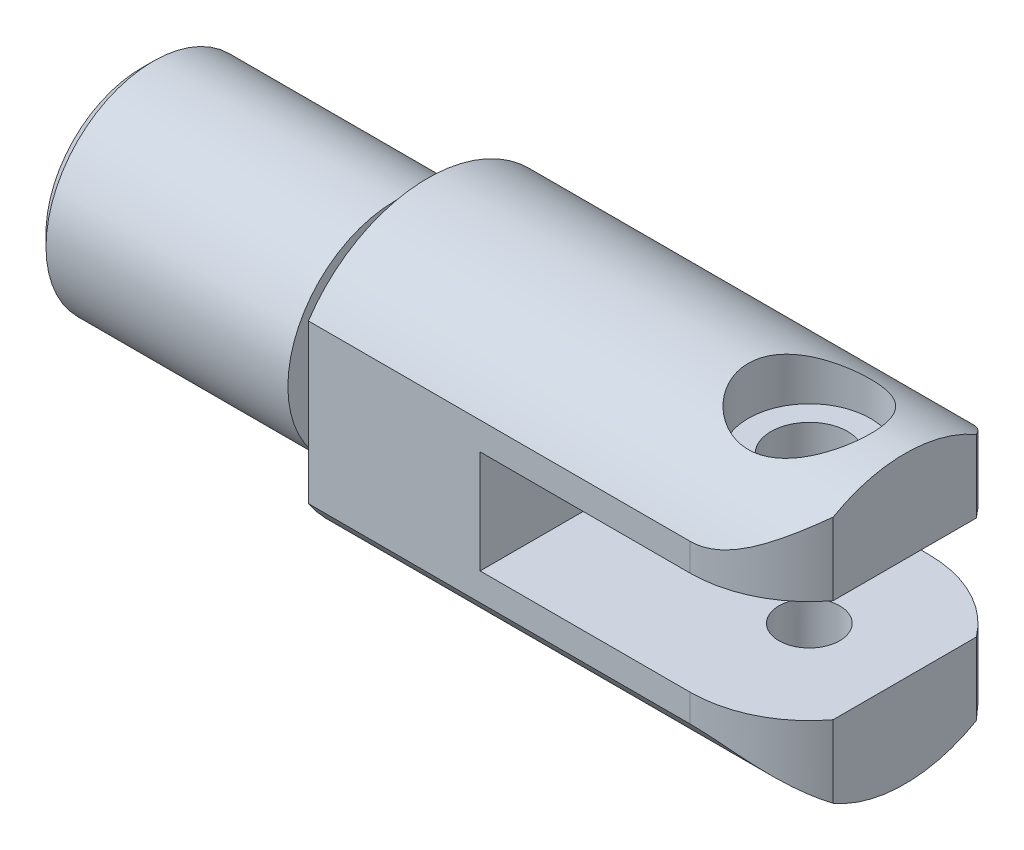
ISO-10303-21;
HEADER;
FILE_DESCRIPTION(('STEP AP214'),'2;1');
FILE_NAME('part.step','',(''),(''),'','','');
FILE_SCHEMA(('AUTOMOTIVE_DESIGN { 1 0 10303 214 1 1 1 1 }'));
ENDSEC;
DATA;
#1=APPLICATION_CONTEXT('core data for automotive mechanical design processes');
#2=APPLICATION_PROTOCOL_DEFINITION('international standard','automotive_design',2000,#1);
#3=PRODUCT_CONTEXT('',#1,'mechanical');
#4=PRODUCT('Part','Part','',(#3));
#5=PRODUCT_RELATED_PRODUCT_CATEGORY('part','',(#4));
#6=PRODUCT_DEFINITION_FORMATION('','',#4);
#7=PRODUCT_DEFINITION_CONTEXT('part definition',#1,'design');
#8=PRODUCT_DEFINITION('design','',#6,#7);
#9=PRODUCT_DEFINITION_SHAPE('','',#8);
#10=(LENGTH_UNIT() NAMED_UNIT(*) SI_UNIT(.MILLI.,.METRE.));
#11=(NAMED_UNIT(*) PLANE_ANGLE_UNIT() SI_UNIT($,.RADIAN.));
#12=(NAMED_UNIT(*) SI_UNIT($,.STERADIAN.) SOLID_ANGLE_UNIT());
#13=UNCERTAINTY_MEASURE_WITH_UNIT(LENGTH_MEASURE(1.E-05),#10,'distance_accuracy_value','');
#14=(GEOMETRIC_REPRESENTATION_CONTEXT(3) GLOBAL_UNCERTAINTY_ASSIGNED_CONTEXT((#13)) GLOBAL_UNIT_ASSIGNED_CONTEXT((#10,
#11,#12)) REPRESENTATION_CONTEXT('',''));
#15=CARTESIAN_POINT('',(0.,0.,0.));
#16=DIRECTION('',(0.,0.,1.));
#17=DIRECTION('',(1.,0.,0.));
#18=AXIS2_PLACEMENT_3D('',#15,#16,#17);
#19=CARTESIAN_POINT('',(-8.17722948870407,0.,0.));
#20=DIRECTION('',(-1.,0.,0.));
#21=DIRECTION('',(0.,0.,1.));
#22=AXIS2_PLACEMENT_3D('',#19,#20,#21);
#23=CYLINDRICAL_SURFACE('',#22,9.525);
#24=CARTESIAN_POINT('',(21.336,9.525,0.));
#25=CARTESIAN_POINT('',(21.3360008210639,9.52499934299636,0.10866366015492));
#26=CARTESIAN_POINT('',(21.3403642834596,9.52313534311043,0.21736117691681));
#27=CARTESIAN_POINT('',(21.3577753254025,9.51572643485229,0.433977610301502));
#28=CARTESIAN_POINT('',(21.3708282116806,9.5101792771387,0.541896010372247));
#29=CARTESIAN_POINT('',(21.4055197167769,9.49553324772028,0.756330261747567));
#30=CARTESIAN_POINT('',(21.4271754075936,9.48642731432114,0.862842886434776));
#31=CARTESIAN_POINT('',(21.4788407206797,9.46490766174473,1.07349454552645));
#32=CARTESIAN_POINT('',(21.508853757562,9.45249259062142,1.17763259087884));
#33=CARTESIAN_POINT('',(21.6107652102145,9.41084087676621,1.4846075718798));
#34=CARTESIAN_POINT('',(21.6946983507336,9.3771259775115,1.68299258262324));
#35=CARTESIAN_POINT('',(21.8917585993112,9.30102487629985,2.06256219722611));
#36=CARTESIAN_POINT('',(22.0048776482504,9.25864106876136,2.24375153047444));
#37=CARTESIAN_POINT('',(22.2633646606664,9.16693748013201,2.59366760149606));
#38=CARTESIAN_POINT('',(22.4100123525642,9.11738344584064,2.7613892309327));
#39=CARTESIAN_POINT('',(22.7286289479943,9.01791633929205,3.07071174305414));
#40=CARTESIAN_POINT('',(22.900611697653,8.96800308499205,3.21229824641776));
#41=CARTESIAN_POINT('',(23.276069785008,8.87052609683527,3.47271718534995));
#42=CARTESIAN_POINT('',(23.4807200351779,8.82322080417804,3.58997709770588));
#43=CARTESIAN_POINT('',(23.8017672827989,8.76086669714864,3.73841034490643));
#44=CARTESIAN_POINT('',(23.9111729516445,8.74151020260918,3.78332392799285));
#45=CARTESIAN_POINT('',(24.1339708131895,8.70633633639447,3.86358074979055));
#46=CARTESIAN_POINT('',(24.2473608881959,8.69051711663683,3.89892898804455));
#47=CARTESIAN_POINT('',(24.4715910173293,8.66369983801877,3.95814785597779));
#48=CARTESIAN_POINT('',(24.5822807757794,8.65250238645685,3.98249880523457));
#49=CARTESIAN_POINT('',(24.8055966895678,8.63426151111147,4.02189336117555));
#50=CARTESIAN_POINT('',(24.918221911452,8.62721613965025,4.0369413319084));
#51=CARTESIAN_POINT('',(25.1444942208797,8.61754258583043,4.05755040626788));
#52=CARTESIAN_POINT('',(25.2581410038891,8.61491312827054,4.06311424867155));
#53=CARTESIAN_POINT('',(25.4855107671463,8.61416958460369,4.06469042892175));
#54=CARTESIAN_POINT('',(25.5992337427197,8.61605524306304,4.06070330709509));
#55=CARTESIAN_POINT('',(25.8165554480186,8.62393394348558,4.04394188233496));
#56=CARTESIAN_POINT('',(25.9202245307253,8.62958002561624,4.0319095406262));
#57=CARTESIAN_POINT('',(26.1260936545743,8.64443007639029,3.99996913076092));
#58=CARTESIAN_POINT('',(26.228293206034,8.65363520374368,3.98005849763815));
#59=CARTESIAN_POINT('',(26.5316009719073,8.68618548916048,3.90878671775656));
#60=CARTESIAN_POINT('',(26.7295952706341,8.71447270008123,3.84587168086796));
#61=CARTESIAN_POINT('',(27.1163154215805,8.78168870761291,3.68983240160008));
#62=CARTESIAN_POINT('',(27.3047461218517,8.82083552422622,3.59608102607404));
#63=CARTESIAN_POINT('',(27.6639861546,8.90531591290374,3.3814583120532));
#64=CARTESIAN_POINT('',(27.834788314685,8.95065198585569,3.26057599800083));
#65=CARTESIAN_POINT('',(28.1698907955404,9.04730919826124,2.98250361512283));
#66=CARTESIAN_POINT('',(28.3322585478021,9.09880384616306,2.82303927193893));
#67=CARTESIAN_POINT('',(28.628615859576,9.19858639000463,2.47865956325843));
#68=CARTESIAN_POINT('',(28.7625981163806,9.24687345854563,2.29373766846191));
#69=CARTESIAN_POINT('',(29.0014011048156,9.33632842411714,1.89757838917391));
#70=CARTESIAN_POINT('',(29.1053993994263,9.37728559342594,1.68579411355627));
#71=CARTESIAN_POINT('',(29.275607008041,9.44583248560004,1.24554106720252));
#72=CARTESIAN_POINT('',(29.3418382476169,9.47342996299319,1.01708206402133));
#73=CARTESIAN_POINT('',(29.4305034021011,9.51067755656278,0.566077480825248));
#74=CARTESIAN_POINT('',(29.4555276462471,9.52138717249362,0.344128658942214));
#75=CARTESIAN_POINT('',(29.468836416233,9.52706177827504,-0.101038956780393));
#76=CARTESIAN_POINT('',(29.4571321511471,9.52203157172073,-0.324257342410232));
#77=CARTESIAN_POINT('',(29.3991377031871,9.49747404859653,-0.753254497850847));
#78=CARTESIAN_POINT('',(29.3546985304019,9.47872294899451,-0.959333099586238));
#79=CARTESIAN_POINT('',(29.2351069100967,9.42945477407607,-1.36086413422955));
#80=CARTESIAN_POINT('',(29.1599506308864,9.39893623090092,-1.55631523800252));
#81=CARTESIAN_POINT('',(28.9786182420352,9.32785482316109,-1.93794208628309));
#82=CARTESIAN_POINT('',(28.8715471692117,9.28700818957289,-2.12363793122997));
#83=CARTESIAN_POINT('',(28.6303932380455,9.19958482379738,-2.47509872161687));
#84=CARTESIAN_POINT('',(28.4962988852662,9.15300565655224,-2.64085513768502));
#85=CARTESIAN_POINT('',(28.19323620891,9.05481219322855,-2.96075320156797));
#86=CARTESIAN_POINT('',(28.0224102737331,9.003081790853,-3.11310036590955));
#87=CARTESIAN_POINT('',(27.6567195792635,8.90345400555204,-3.38755158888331));
#88=CARTESIAN_POINT('',(27.4618483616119,8.85555765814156,-3.50964749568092));
#89=CARTESIAN_POINT('',(27.1533296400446,8.79052306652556,-3.66819683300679));
#90=CARTESIAN_POINT('',(27.0467491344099,8.76982477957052,-3.7172756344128));
#91=CARTESIAN_POINT('',(26.8292663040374,8.73160336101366,-3.80618853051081));
#92=CARTESIAN_POINT('',(26.7183659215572,8.71407882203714,-3.8460267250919));
#93=CARTESIAN_POINT('',(26.4930881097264,8.68285270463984,-3.91601382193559));
#94=CARTESIAN_POINT('',(26.3787124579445,8.66914920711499,-3.94616758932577));
#95=CARTESIAN_POINT('',(26.1473474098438,8.64608681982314,-3.99644541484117));
#96=CARTESIAN_POINT('',(26.0303582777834,8.63672749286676,-4.01657048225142));
#97=CARTESIAN_POINT('',(25.8042315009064,8.62329579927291,-4.04532123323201));
#98=CARTESIAN_POINT('',(25.6952155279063,8.6188600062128,-4.05473887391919));
#99=CARTESIAN_POINT('',(25.476650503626,8.61414322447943,-4.06475000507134));
#100=CARTESIAN_POINT('',(25.3671012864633,8.61386362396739,-4.06534054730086));
#101=CARTESIAN_POINT('',(25.1484361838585,8.61747512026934,-4.05768013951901));
#102=CARTESIAN_POINT('',(25.0393200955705,8.62136395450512,-4.04943398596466));
#103=CARTESIAN_POINT('',(24.8223078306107,8.63316177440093,-4.02421710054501));
#104=CARTESIAN_POINT('',(24.7144121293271,8.64107227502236,-4.00724308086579));
#105=CARTESIAN_POINT('',(24.4048386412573,8.66944805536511,-3.94567511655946));
#106=CARTESIAN_POINT('',(24.205698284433,8.69481262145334,-3.88995921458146));
#107=CARTESIAN_POINT('',(23.8196904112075,8.75616396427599,-3.74979969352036));
#108=CARTESIAN_POINT('',(23.6328263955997,8.79215375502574,-3.66534792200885));
#109=CARTESIAN_POINT('',(23.263919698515,8.87344533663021,-3.46410833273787));
#110=CARTESIAN_POINT('',(23.0828854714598,8.91918460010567,-3.3456471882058));
#111=CARTESIAN_POINT('',(22.7422999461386,9.01365945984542,-3.0820743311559));
#112=CARTESIAN_POINT('',(22.582756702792,9.06239616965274,-2.93695267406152));
#113=CARTESIAN_POINT('',(22.2767817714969,9.16195780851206,-2.61062025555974));
#114=CARTESIAN_POINT('',(22.1323402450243,9.21264956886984,-2.42747859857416));
#115=CARTESIAN_POINT('',(21.9402781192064,9.28308520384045,-2.13543173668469));
#116=CARTESIAN_POINT('',(21.880318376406,9.30564628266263,-2.03510428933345));
#117=CARTESIAN_POINT('',(21.7690823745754,9.34828589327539,-1.82926039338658));
#118=CARTESIAN_POINT('',(21.717802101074,9.3683655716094,-1.72374637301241));
#119=CARTESIAN_POINT('',(21.6250734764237,9.40520149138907,-1.5097783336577));
#120=CARTESIAN_POINT('',(21.5834942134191,9.42200141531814,-1.40138850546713));
#121=CARTESIAN_POINT('',(21.5096674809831,9.4521468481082,-1.18105749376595));
#122=CARTESIAN_POINT('',(21.4774155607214,9.46549400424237,-1.06911803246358));
#123=CARTESIAN_POINT('',(21.4226489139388,9.48832084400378,-0.842792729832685));
#124=CARTESIAN_POINT('',(21.4001104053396,9.49780997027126,-0.728413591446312));
#125=CARTESIAN_POINT('',(21.3649377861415,9.51267573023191,-0.497936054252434));
#126=CARTESIAN_POINT('',(21.3522965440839,9.51805532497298,-0.381838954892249));
#127=CARTESIAN_POINT('',(21.3417844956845,9.52253317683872,-0.221234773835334));
#128=CARTESIAN_POINT('',(21.3396159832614,9.52345765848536,-0.17702276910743));
#129=CARTESIAN_POINT('',(21.3367235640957,9.52469120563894,-0.0885423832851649));
#130=CARTESIAN_POINT('',(21.3359996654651,9.52500026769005,-0.0442740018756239));
#131=CARTESIAN_POINT('',(21.336,9.525,0.));
#132=B_SPLINE_CURVE_WITH_KNOTS('',3,(#24,#25,#26,#27,#28,#29,#30,#31,#32,#33,#34,#35,#36,#37,
#38,#39,#40,#41,#42,#43,#44,#45,#46,#47,#48,#49,#50,#51,#52,#53,#54,#55,#56,#57,#58,#59,#60,#61,
#62,#63,#64,#65,#66,#67,#68,#69,#70,#71,#72,#73,#74,#75,#76,#77,#78,#79,#80,#81,#82,#83,#84,#85,
#86,#87,#88,#89,#90,#91,#92,#93,#94,#95,#96,#97,#98,#99,#100,#101,#102,#103,#104,#105,#106,#107,
#108,#109,#110,#111,#112,#113,#114,#115,#116,#117,#118,#119,#120,#121,#122,#123,#124,#125,#126,
#127,#128,#129,#130,#131),.UNSPECIFIED.,.T.,.F.,(4,2,2,2,2,2,2,2,2,2,2,2,2,2,2,2,2,2,2,2,2,2,2,
2,2,2,2,2,2,2,2,2,2,2,2,2,2,2,2,2,2,2,2,2,2,2,2,2,2,2,2,2,2,4),(0.,0.325945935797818,
0.652091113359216,0.978886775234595,1.30581615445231,1.95670379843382,2.60741190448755,
3.28912343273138,3.97120892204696,4.68888037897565,5.04799133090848,5.40691422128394,
5.74812482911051,6.08917525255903,6.43012717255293,6.77105980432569,7.08423090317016,
7.39750404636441,8.02352392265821,8.66315621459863,9.30304773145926,9.99990659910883,
10.6969445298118,11.4115959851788,12.1258321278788,12.793168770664,13.4603017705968,
14.0923546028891,14.7244863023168,15.3763478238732,16.0284872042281,16.7293758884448,
17.4304532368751,17.7875048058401,18.1443976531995,18.5011109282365,18.8577882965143,
19.1858967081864,19.5141147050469,19.8421546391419,20.1703182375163,20.7923376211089,
21.4145336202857,22.0751103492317,22.7359339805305,23.4482461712,23.8049880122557,
24.1615643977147,24.5130075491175,24.8642827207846,25.2146928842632,25.5648503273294,
25.6976532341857,25.8304568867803),.UNSPECIFIED.);
#133=CARTESIAN_POINT('',(21.336,9.525,0.));
#134=VERTEX_POINT('',#133);
#135=EDGE_CURVE('E503',#134,#134,#132,.T.);
#136=ORIENTED_EDGE('',*,*,#135,.F.);
#137=EDGE_LOOP('',(#136));
#138=FACE_BOUND('',#137,.T.);
#139=CARTESIAN_POINT('',(31.75,8.24889197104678,4.7625));
#140=CARTESIAN_POINT('',(31.6748043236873,8.19100911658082,4.86275569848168));
#141=CARTESIAN_POINT('',(31.5975763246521,8.1319746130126,4.96078527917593));
#142=CARTESIAN_POINT('',(31.4392334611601,8.01195268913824,5.1523799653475));
#143=CARTESIAN_POINT('',(31.3581192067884,7.95096557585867,5.24594576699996));
#144=CARTESIAN_POINT('',(31.1092610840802,7.76563529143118,5.51988299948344));
#145=CARTESIAN_POINT('',(30.9359256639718,7.63886409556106,5.69359538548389));
#146=CARTESIAN_POINT('',(30.5738875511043,7.38068891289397,6.02457559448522));
#147=CARTESIAN_POINT('',(30.3850622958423,7.24925382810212,6.1816840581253));
#148=CARTESIAN_POINT('',(29.9938716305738,6.98601400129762,6.47768598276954));
#149=CARTESIAN_POINT('',(29.7915073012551,6.85420928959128,6.61658089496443));
#150=CARTESIAN_POINT('',(29.4220539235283,6.62441830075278,6.84562261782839));
#151=CARTESIAN_POINT('',(29.2577580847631,6.52572013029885,6.93958016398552));
#152=CARTESIAN_POINT('',(28.9209376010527,6.33243000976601,7.116396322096));
#153=CARTESIAN_POINT('',(28.7484127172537,6.23783817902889,7.19925461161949));
#154=CARTESIAN_POINT('',(28.3952570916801,6.05561623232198,7.3531843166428));
#155=CARTESIAN_POINT('',(28.214649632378,5.96796791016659,7.42428712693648));
#156=CARTESIAN_POINT('',(27.8447621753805,5.80268575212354,7.55417115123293));
#157=CARTESIAN_POINT('',(27.6554869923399,5.7250464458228,7.61295910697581));
#158=CARTESIAN_POINT('',(27.2046239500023,5.56069881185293,7.7342000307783));
#159=CARTESIAN_POINT('',(26.9395792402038,5.47928653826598,7.79159890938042));
#160=CARTESIAN_POINT('',(26.5330358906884,5.38406353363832,7.85741474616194));
#161=CARTESIAN_POINT('',(26.3962251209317,5.35682470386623,7.87596098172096));
#162=CARTESIAN_POINT('',(26.1202355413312,5.31243544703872,7.9059713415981));
#163=CARTESIAN_POINT('',(25.9810584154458,5.29527813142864,7.91744030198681));
#164=CARTESIAN_POINT('',(25.7679784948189,5.27747841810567,7.92930613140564));
#165=CARTESIAN_POINT('',(25.6945293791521,5.27286238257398,7.93237470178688));
#166=CARTESIAN_POINT('',(25.5473912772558,5.2666902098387,7.9364731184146));
#167=CARTESIAN_POINT('',(25.4737021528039,5.2651363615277,7.93750143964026));
#168=CARTESIAN_POINT('',(25.4,5.2651418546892,7.9375));
#169=B_SPLINE_CURVE_WITH_KNOTS('',3,(#139,#140,#141,#142,#143,#144,#145,#146,#147,#148,#149,
#150,#151,#152,#153,#154,#155,#156,#157,#158,#159,#160,#161,#162,#163,#164,#165,#166,#167,#168),
.UNSPECIFIED.,.F.,.F.,(4,2,2,2,2,2,2,2,2,2,2,2,2,2,4),(0.,0.414045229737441,0.828025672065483,
1.65556887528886,2.49044513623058,3.32525483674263,3.96518399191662,4.60513173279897,
5.24334177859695,5.88120151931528,6.72702441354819,7.14874510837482,7.57017731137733,
7.79107009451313,8.01212792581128),.UNSPECIFIED.);
#170=CARTESIAN_POINT('',(31.75,8.24889197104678,4.7625));
#171=VERTEX_POINT('',#170);
#172=CARTESIAN_POINT('',(25.4,5.2651418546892,7.9375));
#173=VERTEX_POINT('',#172);
#174=EDGE_CURVE('E427',#171,#173,#169,.T.);
#175=ORIENTED_EDGE('',*,*,#174,.F.);
#176=CARTESIAN_POINT('',(31.75,0.,0.));
#177=DIRECTION('',(-1.,0.,0.));
#178=DIRECTION('',(0.,0.,1.));
#179=AXIS2_PLACEMENT_3D('',#176,#177,#178);
#180=CIRCLE('',#179,9.525);
#181=CARTESIAN_POINT('',(31.75,8.24889197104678,-4.7625));
#182=VERTEX_POINT('',#181);
#183=EDGE_CURVE('E509',#171,#182,#180,.T.);
#184=ORIENTED_EDGE('',*,*,#183,.T.);
#185=CARTESIAN_POINT('',(25.4,5.26514185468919,-7.9375));
#186=CARTESIAN_POINT('',(25.5418413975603,5.2650396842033,-7.93753374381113));
#187=CARTESIAN_POINT('',(25.6836188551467,5.27087100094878,-7.93369959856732));
#188=CARTESIAN_POINT('',(25.965617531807,5.29360135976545,-7.91856910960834));
#189=CARTESIAN_POINT('',(26.105841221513,5.31047907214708,-7.90728714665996));
#190=CARTESIAN_POINT('',(26.3817769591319,5.35417885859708,-7.87775554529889));
#191=CARTESIAN_POINT('',(26.5175251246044,5.38084819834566,-7.85961280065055));
#192=CARTESIAN_POINT('',(26.7859874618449,5.44294273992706,-7.81674040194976));
#193=CARTESIAN_POINT('',(26.9186999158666,5.47837277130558,-7.7920071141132));
#194=CARTESIAN_POINT('',(27.2325274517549,5.57219881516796,-7.72532904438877));
#195=CARTESIAN_POINT('',(27.411962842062,5.63413014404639,-7.68044859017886));
#196=CARTESIAN_POINT('',(27.763431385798,5.76898125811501,-7.57968084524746));
#197=CARTESIAN_POINT('',(27.9354614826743,5.84190552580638,-7.52378906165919));
#198=CARTESIAN_POINT('',(28.2735372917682,5.99634354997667,-7.40130254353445));
#199=CARTESIAN_POINT('',(28.4395218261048,6.07792328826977,-7.33462320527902));
#200=CARTESIAN_POINT('',(28.7642883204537,6.24667242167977,-7.19145130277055));
#201=CARTESIAN_POINT('',(28.9230677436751,6.33384375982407,-7.11495531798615));
#202=CARTESIAN_POINT('',(29.3025673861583,6.55117422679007,-6.91649632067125));
#203=CARTESIAN_POINT('',(29.5195271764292,6.68325230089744,-6.78941498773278));
#204=CARTESIAN_POINT('',(29.9394884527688,6.94999480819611,-6.51611293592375));
#205=CARTESIAN_POINT('',(30.1424822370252,7.0846606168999,-6.36988178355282));
#206=CARTESIAN_POINT('',(30.5334169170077,7.35210697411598,-6.05920676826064));
#207=CARTESIAN_POINT('',(30.7214221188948,7.48489331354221,-5.89484882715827));
#208=CARTESIAN_POINT('',(31.0826792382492,7.74590186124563,-5.54741398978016));
#209=CARTESIAN_POINT('',(31.2559375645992,7.87412603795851,-5.36434530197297));
#210=CARTESIAN_POINT('',(31.4779051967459,8.04122297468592,-5.10593361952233));
#211=CARTESIAN_POINT('',(31.5337090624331,8.08349217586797,-5.03876844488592));
#212=CARTESIAN_POINT('',(31.6433429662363,8.16699372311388,-4.90226812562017));
#213=CARTESIAN_POINT('',(31.6971736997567,8.20822643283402,-4.83293376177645));
#214=CARTESIAN_POINT('',(31.7500000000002,8.24889197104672,-4.76250000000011));
#215=B_SPLINE_CURVE_WITH_KNOTS('',3,(#185,#186,#187,#188,#189,#190,#191,#192,#193,#194,#195,
#196,#197,#198,#199,#200,#201,#202,#203,#204,#205,#206,#207,#208,#209,#210,#211,#212,#213,#214),
.UNSPECIFIED.,.F.,.F.,(4,2,2,2,2,2,2,2,2,2,2,2,2,2,4),(0.,0.425250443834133,0.849682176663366,
1.26775671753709,1.68606224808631,2.27027970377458,2.85473602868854,3.44402060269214,
4.03351106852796,4.88444421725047,5.735842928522,6.58336661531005,7.43052007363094,
7.72152653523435,8.01242942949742),.UNSPECIFIED.);
#216=CARTESIAN_POINT('',(25.4,5.2651418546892,-7.9375));
#217=VERTEX_POINT('',#216);
#218=EDGE_CURVE('E402',#217,#182,#215,.T.);
#219=ORIENTED_EDGE('',*,*,#218,.F.);
#220=DIRECTION('',(-1.,0.,0.));
#221=VECTOR('',#220,1.);
#222=CARTESIAN_POINT('',(-8.17722948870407,5.26514185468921,-7.93749999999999));
#223=LINE('',#222,#221);
#224=CARTESIAN_POINT('',(0.,5.2651418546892,-7.9375));
#225=VERTEX_POINT('',#224);
#226=EDGE_CURVE('E385',#225,#217,#223,.F.);
#227=ORIENTED_EDGE('',*,*,#226,.F.);
#228=CARTESIAN_POINT('',(0.,0.,0.));
#229=DIRECTION('',(-1.,0.,0.));
#230=DIRECTION('',(0.,0.,1.));
#231=AXIS2_PLACEMENT_3D('',#228,#229,#230);
#232=CIRCLE('',#231,9.525);
#233=CARTESIAN_POINT('',(0.,5.2651418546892,7.9375));
#234=VERTEX_POINT('',#233);
#235=EDGE_CURVE('E521',#234,#225,#232,.T.);
#236=ORIENTED_EDGE('',*,*,#235,.F.);
#237=DIRECTION('',(-1.,0.,0.));
#238=VECTOR('',#237,1.);
#239=CARTESIAN_POINT('',(-8.17722948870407,5.26514185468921,7.93749999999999));
#240=LINE('',#239,#238);
#241=EDGE_CURVE('E398',#173,#234,#240,.T.);
#242=ORIENTED_EDGE('',*,*,#241,.F.);
#243=EDGE_LOOP('',(#175,#184,#219,#227,#236,#242));
#244=FACE_BOUND('',#243,.T.);
#245=ADVANCED_FACE('F270',(#138,#244),#23,.T.);
#246=CARTESIAN_POINT('',(23.3807,-9.525,0.));
#247=CARTESIAN_POINT('',(23.3807039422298,-9.52499792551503,0.112080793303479));
#248=CARTESIAN_POINT('',(23.3900630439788,-9.52300153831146,0.224210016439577));
#249=CARTESIAN_POINT('',(23.4272166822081,-9.51523028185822,0.445289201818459));
#250=CARTESIAN_POINT('',(23.4550249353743,-9.50945260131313,0.554236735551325));
#251=CARTESIAN_POINT('',(23.528171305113,-9.49476274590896,0.765725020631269));
#252=CARTESIAN_POINT('',(23.5734916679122,-9.48585374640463,0.868272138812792));
#253=CARTESIAN_POINT('',(23.6803207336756,-9.46586534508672,1.06430217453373));
#254=CARTESIAN_POINT('',(23.7418288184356,-9.45478602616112,1.15778543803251));
#255=CARTESIAN_POINT('',(23.8802725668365,-9.43148541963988,1.33445303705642));
#256=CARTESIAN_POINT('',(23.9574060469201,-9.4192506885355,1.41748059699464));
#257=CARTESIAN_POINT('',(24.1244861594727,-9.3951140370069,1.5695212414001));
#258=CARTESIAN_POINT('',(24.2144338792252,-9.38321214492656,1.63853313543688));
#259=CARTESIAN_POINT('',(24.4057367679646,-9.36095669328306,1.76126616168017));
#260=CARTESIAN_POINT('',(24.5072001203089,-9.350620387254,1.814822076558));
#261=CARTESIAN_POINT('',(24.7179413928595,-9.33285866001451,1.90406360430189));
#262=CARTESIAN_POINT('',(24.8272184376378,-9.32543291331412,1.93975121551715));
#263=CARTESIAN_POINT('',(25.048789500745,-9.31446967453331,1.99172833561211));
#264=CARTESIAN_POINT('',(25.1610158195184,-9.31087678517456,2.00829450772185));
#265=CARTESIAN_POINT('',(25.3867079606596,-9.30781955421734,2.02241841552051));
#266=CARTESIAN_POINT('',(25.5001736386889,-9.3083547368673,2.01997834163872));
#267=CARTESIAN_POINT('',(25.7230789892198,-9.31344296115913,1.99638204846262));
#268=CARTESIAN_POINT('',(25.8325543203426,-9.31792734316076,1.97554564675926));
#269=CARTESIAN_POINT('',(26.0464193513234,-9.33030030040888,1.91625416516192));
#270=CARTESIAN_POINT('',(26.150808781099,-9.33818905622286,1.87779815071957));
#271=CARTESIAN_POINT('',(26.352446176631,-9.35655049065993,1.78406110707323));
#272=CARTESIAN_POINT('',(26.4496345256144,-9.3670421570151,1.72865571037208));
#273=CARTESIAN_POINT('',(26.6334534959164,-9.38941542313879,1.60268021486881));
#274=CARTESIAN_POINT('',(26.7200827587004,-9.40129720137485,1.53210816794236));
#275=CARTESIAN_POINT('',(26.882167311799,-9.42540756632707,1.37610254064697));
#276=CARTESIAN_POINT('',(26.9573604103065,-9.43763830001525,1.29039662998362));
#277=CARTESIAN_POINT('',(27.0923470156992,-9.46084863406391,1.1074548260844));
#278=CARTESIAN_POINT('',(27.15214027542,-9.47182821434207,1.01021874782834));
#279=CARTESIAN_POINT('',(27.2546886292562,-9.49133145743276,0.806667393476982));
#280=CARTESIAN_POINT('',(27.2974109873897,-9.49985039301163,0.700335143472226));
#281=CARTESIAN_POINT('',(27.3643103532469,-9.51343711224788,0.481780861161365));
#282=CARTESIAN_POINT('',(27.3884898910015,-9.51850536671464,0.369559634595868));
#283=CARTESIAN_POINT('',(27.4172396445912,-9.52455318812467,0.144663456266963));
#284=CARTESIAN_POINT('',(27.4221682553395,-9.52560747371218,0.0320362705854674));
#285=CARTESIAN_POINT('',(27.4132453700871,-9.5237172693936,-0.192432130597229));
#286=CARTESIAN_POINT('',(27.399395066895,-9.52077303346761,-0.304273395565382));
#287=CARTESIAN_POINT('',(27.3536049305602,-9.51126361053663,-0.52281924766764));
#288=CARTESIAN_POINT('',(27.321851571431,-9.50473576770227,-0.629564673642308));
#289=CARTESIAN_POINT('',(27.2413624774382,-9.48878918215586,-0.836214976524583));
#290=CARTESIAN_POINT('',(27.1926253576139,-9.47937020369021,-0.936119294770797));
#291=CARTESIAN_POINT('',(27.0787949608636,-9.45850108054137,-1.1277443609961));
#292=CARTESIAN_POINT('',(27.0134892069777,-9.44702516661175,-1.21933602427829));
#293=CARTESIAN_POINT('',(26.8686568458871,-9.42337054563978,-1.39038918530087));
#294=CARTESIAN_POINT('',(26.78912851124,-9.41119175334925,-1.46984920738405));
#295=CARTESIAN_POINT('',(26.6164685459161,-9.38724819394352,-1.61578809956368));
#296=CARTESIAN_POINT('',(26.5231260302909,-9.37549418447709,-1.68201955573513));
#297=CARTESIAN_POINT('',(26.3264313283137,-9.35397178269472,-1.79786615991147));
#298=CARTESIAN_POINT('',(26.2230795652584,-9.34420330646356,-1.84748201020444));
#299=CARTESIAN_POINT('',(26.0098445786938,-9.32784749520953,-1.92836475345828));
#300=CARTESIAN_POINT('',(25.9000009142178,-9.3212427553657,-1.9597322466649));
#301=CARTESIAN_POINT('',(25.6764449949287,-9.31192869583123,-2.00352672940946));
#302=CARTESIAN_POINT('',(25.5627333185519,-9.30921879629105,-2.01595653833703));
#303=CARTESIAN_POINT('',(25.3371598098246,-9.30803619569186,-2.02140852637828));
#304=CARTESIAN_POINT('',(25.2253077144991,-9.30947795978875,-2.01482247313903));
#305=CARTESIAN_POINT('',(25.0043454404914,-9.31624365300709,-1.98330139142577));
#306=CARTESIAN_POINT('',(24.8952352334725,-9.32156754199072,-1.95836655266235));
#307=CARTESIAN_POINT('',(24.6831423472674,-9.33545717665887,-1.89103972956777));
#308=CARTESIAN_POINT('',(24.5801419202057,-9.34401294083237,-1.84870145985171));
#309=CARTESIAN_POINT('',(24.3826469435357,-9.3634068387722,-1.74781702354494));
#310=CARTESIAN_POINT('',(24.288153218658,-9.37424519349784,-1.68926928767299));
#311=CARTESIAN_POINT('',(24.1084154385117,-9.39724086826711,-1.55631419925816));
#312=CARTESIAN_POINT('',(24.0233816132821,-9.40941936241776,-1.48162625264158));
#313=CARTESIAN_POINT('',(23.8669251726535,-9.43357733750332,-1.31908354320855));
#314=CARTESIAN_POINT('',(23.7955056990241,-9.44555677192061,-1.23122574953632));
#315=CARTESIAN_POINT('',(23.6674868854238,-9.46813741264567,-1.04356508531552));
#316=CARTESIAN_POINT('',(23.6110761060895,-9.47872031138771,-0.94363126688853));
#317=CARTESIAN_POINT('',(23.5159404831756,-9.49713321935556,-0.735500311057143));
#318=CARTESIAN_POINT('',(23.4772003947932,-9.50496560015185,-0.627310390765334));
#319=CARTESIAN_POINT('',(23.4256324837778,-9.5155513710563,-0.432467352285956));
#320=CARTESIAN_POINT('',(23.4088141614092,-9.51907311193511,-0.346889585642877));
#321=CARTESIAN_POINT('',(23.3863466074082,-9.52379818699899,-0.174217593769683));
#322=CARTESIAN_POINT('',(23.3806969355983,-9.52500161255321,-0.0871234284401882));
#323=CARTESIAN_POINT('',(23.3807,-9.525,0.));
#324=B_SPLINE_CURVE_WITH_KNOTS('',3,(#246,#247,#248,#249,#250,#251,#252,#253,#254,#255,#256,
#257,#258,#259,#260,#261,#262,#263,#264,#265,#266,#267,#268,#269,#270,#271,#272,#273,#274,#275,
#276,#277,#278,#279,#280,#281,#282,#283,#284,#285,#286,#287,#288,#289,#290,#291,#292,#293,#294,
#295,#296,#297,#298,#299,#300,#301,#302,#303,#304,#305,#306,#307,#308,#309,#310,#311,#312,#313,
#314,#315,#316,#317,#318,#319,#320,#321,#322,#323),.UNSPECIFIED.,.T.,.F.,(4,2,2,2,2,2,2,2,2,2,2,
2,2,2,2,2,2,2,2,2,2,2,2,2,2,2,2,2,2,2,2,2,2,2,2,2,2,2,4),(0.,0.335923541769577,
0.672097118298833,1.00793077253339,1.34375160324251,1.68412441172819,2.02452611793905,
2.36844212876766,2.71231966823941,3.0511567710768,3.3899548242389,3.72297640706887,
4.05601565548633,4.39155972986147,4.72714692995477,5.06953880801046,5.41193618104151,
5.75498703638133,6.09799107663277,6.43457808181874,6.77114370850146,7.10426684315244,
7.43741714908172,7.77507719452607,8.11277827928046,8.45630137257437,8.79980994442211,
9.1414064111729,9.48295201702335,9.81751157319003,10.1520676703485,10.4855988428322,
10.8191623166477,11.1590732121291,11.4990624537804,11.8431405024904,12.1869211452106,
12.4480538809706,12.709176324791),.UNSPECIFIED.);
#325=CARTESIAN_POINT('',(23.3807,-9.525,0.));
#326=VERTEX_POINT('',#325);
#327=EDGE_CURVE('E451',#326,#326,#324,.T.);
#328=ORIENTED_EDGE('',*,*,#327,.T.);
#329=EDGE_LOOP('',(#328));
#330=FACE_BOUND('',#329,.T.);
#331=CARTESIAN_POINT('',(25.4,-5.2651418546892,7.9375));
#332=CARTESIAN_POINT('',(25.5418413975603,-5.26503968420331,7.93753374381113));
#333=CARTESIAN_POINT('',(25.6836188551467,-5.27087100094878,7.93369959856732));
#334=CARTESIAN_POINT('',(25.965617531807,-5.29360135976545,7.91856910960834));
#335=CARTESIAN_POINT('',(26.105841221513,-5.31047907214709,7.90728714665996));
#336=CARTESIAN_POINT('',(26.3817769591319,-5.35417885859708,7.87775554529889));
#337=CARTESIAN_POINT('',(26.5175251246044,-5.38084819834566,7.85961280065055));
#338=CARTESIAN_POINT('',(26.7859874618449,-5.44294273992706,7.81674040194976));
#339=CARTESIAN_POINT('',(26.9186999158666,-5.47837277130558,7.7920071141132));
#340=CARTESIAN_POINT('',(27.2325274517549,-5.57219881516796,7.72532904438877));
#341=CARTESIAN_POINT('',(27.411962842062,-5.63413014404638,7.68044859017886));
#342=CARTESIAN_POINT('',(27.763431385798,-5.76898125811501,7.57968084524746));
#343=CARTESIAN_POINT('',(27.9354614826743,-5.84190552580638,7.52378906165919));
#344=CARTESIAN_POINT('',(28.2735372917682,-5.99634354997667,7.40130254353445));
#345=CARTESIAN_POINT('',(28.4395218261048,-6.07792328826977,7.33462320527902));
#346=CARTESIAN_POINT('',(28.7642883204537,-6.24667242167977,7.19145130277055));
#347=CARTESIAN_POINT('',(28.9230677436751,-6.33384375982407,7.11495531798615));
#348=CARTESIAN_POINT('',(29.3025673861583,-6.55117422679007,6.91649632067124));
#349=CARTESIAN_POINT('',(29.5195271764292,-6.68325230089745,6.78941498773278));
#350=CARTESIAN_POINT('',(29.9394884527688,-6.94999480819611,6.51611293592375));
#351=CARTESIAN_POINT('',(30.1424822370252,-7.0846606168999,6.36988178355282));
#352=CARTESIAN_POINT('',(30.5334169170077,-7.35210697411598,6.05920676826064));
#353=CARTESIAN_POINT('',(30.7214221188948,-7.48489331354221,5.89484882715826));
#354=CARTESIAN_POINT('',(31.0826792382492,-7.74590186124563,5.54741398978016));
#355=CARTESIAN_POINT('',(31.2559375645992,-7.87412603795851,5.36434530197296));
#356=CARTESIAN_POINT('',(31.4779051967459,-8.04122297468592,5.10593361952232));
#357=CARTESIAN_POINT('',(31.5337090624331,-8.08349217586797,5.03876844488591));
#358=CARTESIAN_POINT('',(31.6433429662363,-8.16699372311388,4.90226812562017));
#359=CARTESIAN_POINT('',(31.6971736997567,-8.20822643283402,4.83293376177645));
#360=CARTESIAN_POINT('',(31.7500000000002,-8.24889197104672,4.76250000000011));
#361=B_SPLINE_CURVE_WITH_KNOTS('',3,(#331,#332,#333,#334,#335,#336,#337,#338,#339,#340,#341,
#342,#343,#344,#345,#346,#347,#348,#349,#350,#351,#352,#353,#354,#355,#356,#357,#358,#359,#360),
.UNSPECIFIED.,.F.,.F.,(4,2,2,2,2,2,2,2,2,2,2,2,2,2,4),(0.,0.425250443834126,0.849682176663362,
1.26775671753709,1.68606224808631,2.27027970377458,2.85473602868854,3.44402060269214,
4.03351106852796,4.88444421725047,5.73584292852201,6.58336661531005,7.43052007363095,
7.72152653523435,8.01242942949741),.UNSPECIFIED.);
#362=CARTESIAN_POINT('',(25.4,-5.26514185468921,7.9375));
#363=VERTEX_POINT('',#362);
#364=CARTESIAN_POINT('',(31.75,-8.24889197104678,4.7625));
#365=VERTEX_POINT('',#364);
#366=EDGE_CURVE('E434',#363,#365,#361,.T.);
#367=ORIENTED_EDGE('',*,*,#366,.F.);
#368=DIRECTION('',(-1.,0.,0.));
#369=VECTOR('',#368,1.);
#370=CARTESIAN_POINT('',(-8.17722948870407,-5.26514185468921,7.93749999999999));
#371=LINE('',#370,#369);
#372=CARTESIAN_POINT('',(0.,-5.2651418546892,7.9375));
#373=VERTEX_POINT('',#372);
#374=EDGE_CURVE('E396',#373,#363,#371,.F.);
#375=ORIENTED_EDGE('',*,*,#374,.F.);
#376=CARTESIAN_POINT('',(0.,-5.2651418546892,-7.9375));
#377=VERTEX_POINT('',#376);
#378=EDGE_CURVE('E384',#377,#373,#232,.T.);
#379=ORIENTED_EDGE('',*,*,#378,.F.);
#380=DIRECTION('',(-1.,0.,0.));
#381=VECTOR('',#380,1.);
#382=CARTESIAN_POINT('',(-8.17722948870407,-5.26514185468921,-7.93749999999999));
#383=LINE('',#382,#381);
#384=CARTESIAN_POINT('',(25.4,-5.26514185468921,-7.9375));
#385=VERTEX_POINT('',#384);
#386=EDGE_CURVE('E373',#385,#377,#383,.T.);
#387=ORIENTED_EDGE('',*,*,#386,.F.);
#388=CARTESIAN_POINT('',(31.75,-8.24889197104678,-4.7625));
#389=CARTESIAN_POINT('',(31.6748043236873,-8.19100911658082,-4.86275569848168));
#390=CARTESIAN_POINT('',(31.5975763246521,-8.13197461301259,-4.96078527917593));
#391=CARTESIAN_POINT('',(31.4392334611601,-8.01195268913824,-5.15237996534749));
#392=CARTESIAN_POINT('',(31.3581192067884,-7.95096557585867,-5.24594576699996));
#393=CARTESIAN_POINT('',(31.1092610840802,-7.76563529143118,-5.51988299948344));
#394=CARTESIAN_POINT('',(30.9359256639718,-7.63886409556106,-5.69359538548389));
#395=CARTESIAN_POINT('',(30.5738875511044,-7.38068891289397,-6.02457559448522));
#396=CARTESIAN_POINT('',(30.3850622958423,-7.24925382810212,-6.1816840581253));
#397=CARTESIAN_POINT('',(29.9938716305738,-6.98601400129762,-6.47768598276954));
#398=CARTESIAN_POINT('',(29.7915073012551,-6.85420928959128,-6.61658089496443));
#399=CARTESIAN_POINT('',(29.4220539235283,-6.62441830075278,-6.84562261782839));
#400=CARTESIAN_POINT('',(29.2577580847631,-6.52572013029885,-6.93958016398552));
#401=CARTESIAN_POINT('',(28.9209376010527,-6.332430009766,-7.116396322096));
#402=CARTESIAN_POINT('',(28.7484127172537,-6.23783817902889,-7.19925461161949));
#403=CARTESIAN_POINT('',(28.3952570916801,-6.05561623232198,-7.3531843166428));
#404=CARTESIAN_POINT('',(28.214649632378,-5.96796791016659,-7.42428712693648));
#405=CARTESIAN_POINT('',(27.8447621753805,-5.80268575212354,-7.55417115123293));
#406=CARTESIAN_POINT('',(27.6554869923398,-5.7250464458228,-7.61295910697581));
#407=CARTESIAN_POINT('',(27.2046239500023,-5.56069881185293,-7.73420003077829));
#408=CARTESIAN_POINT('',(26.9395792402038,-5.47928653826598,-7.79159890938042));
#409=CARTESIAN_POINT('',(26.5330358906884,-5.38406353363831,-7.85741474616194));
#410=CARTESIAN_POINT('',(26.3962251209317,-5.35682470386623,-7.87596098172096));
#411=CARTESIAN_POINT('',(26.1202355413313,-5.31243544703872,-7.9059713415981));
#412=CARTESIAN_POINT('',(25.9810584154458,-5.29527813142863,-7.91744030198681));
#413=CARTESIAN_POINT('',(25.7679784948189,-5.27747841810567,-7.92930613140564));
#414=CARTESIAN_POINT('',(25.6945293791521,-5.27286238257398,-7.93237470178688));
#415=CARTESIAN_POINT('',(25.5473912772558,-5.26669020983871,-7.9364731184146));
#416=CARTESIAN_POINT('',(25.4737021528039,-5.2651363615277,-7.93750143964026));
#417=CARTESIAN_POINT('',(25.4,-5.26514185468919,-7.9375));
#418=B_SPLINE_CURVE_WITH_KNOTS('',3,(#388,#389,#390,#391,#392,#393,#394,#395,#396,#397,#398,
#399,#400,#401,#402,#403,#404,#405,#406,#407,#408,#409,#410,#411,#412,#413,#414,#415,#416,#417),
.UNSPECIFIED.,.F.,.F.,(4,2,2,2,2,2,2,2,2,2,2,2,2,2,4),(0.,0.414045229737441,0.828025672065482,
1.65556887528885,2.49044513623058,3.32525483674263,3.96518399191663,4.60513173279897,
5.24334177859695,5.88120151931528,6.72702441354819,7.14874510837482,7.57017731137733,
7.79107009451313,8.01212792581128),.UNSPECIFIED.);
#419=CARTESIAN_POINT('',(31.75,-8.24889197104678,-4.7625));
#420=VERTEX_POINT('',#419);
#421=EDGE_CURVE('E359',#420,#385,#418,.T.);
#422=ORIENTED_EDGE('',*,*,#421,.F.);
#423=EDGE_CURVE('E519',#420,#365,#180,.T.);
#424=ORIENTED_EDGE('',*,*,#423,.T.);
#425=EDGE_LOOP('',(#367,#375,#379,#387,#422,#424));
#426=FACE_BOUND('',#425,.T.);
#427=ADVANCED_FACE('F381',(#330,#426),#23,.T.);
#428=CARTESIAN_POINT('',(31.75,9.525,0.));
#429=DIRECTION('',(-1.,0.,0.));
#430=DIRECTION('',(0.,0.,1.));
#431=AXIS2_PLACEMENT_3D('',#428,#429,#430);
#432=PLANE('',#431);
#433=DIRECTION('',(0.,1.,0.));
#434=VECTOR('',#433,1.);
#435=CARTESIAN_POINT('',(31.75,-9.525,4.7625));
#436=LINE('',#435,#434);
#437=CARTESIAN_POINT('',(31.75,-3.429,4.7625));
#438=VERTEX_POINT('',#437);
#439=EDGE_CURVE('E442',#365,#438,#436,.T.);
#440=ORIENTED_EDGE('',*,*,#439,.F.);
#441=ORIENTED_EDGE('',*,*,#423,.F.);
#442=DIRECTION('',(0.,1.,0.));
#443=VECTOR('',#442,1.);
#444=CARTESIAN_POINT('',(31.75,-9.525,-4.7625));
#445=LINE('',#444,#443);
#446=CARTESIAN_POINT('',(31.75,-3.429,-4.7625));
#447=VERTEX_POINT('',#446);
#448=EDGE_CURVE('E365',#447,#420,#445,.F.);
#449=ORIENTED_EDGE('',*,*,#448,.F.);
#450=DIRECTION('',(0.,0.,1.));
#451=VECTOR('',#450,1.);
#452=CARTESIAN_POINT('',(31.75,-3.429,0.));
#453=LINE('',#452,#451);
#454=EDGE_CURVE('E536',#447,#438,#453,.T.);
#455=ORIENTED_EDGE('',*,*,#454,.T.);
#456=EDGE_LOOP('',(#440,#441,#449,#455));
#457=FACE_BOUND('',#456,.T.);
#458=ADVANCED_FACE('F483',(#457),#432,.F.);
#459=CARTESIAN_POINT('',(0.,5.715,0.));
#460=DIRECTION('',(1.,0.,0.));
#461=DIRECTION('',(0.,0.,-1.));
#462=AXIS2_PLACEMENT_3D('',#459,#460,#461);
#463=PLANE('',#462);
#464=CARTESIAN_POINT('',(0.,0.,0.));
#465=DIRECTION('',(-1.,0.,0.));
#466=DIRECTION('',(0.,0.,1.));
#467=AXIS2_PLACEMENT_3D('',#464,#465,#466);
#468=CIRCLE('',#467,5.715);
#469=CARTESIAN_POINT('',(0.,0.,5.715));
#470=VERTEX_POINT('',#469);
#471=EDGE_CURVE('E525',#470,#470,#468,.T.);
#472=ORIENTED_EDGE('',*,*,#471,.F.);
#473=EDGE_LOOP('',(#472));
#474=FACE_BOUND('',#473,.T.);
#475=DIRECTION('',(0.,-1.,0.));
#476=VECTOR('',#475,1.);
#477=CARTESIAN_POINT('',(0.,5.715,7.9375));
#478=LINE('',#477,#476);
#479=EDGE_CURVE('E394',#234,#373,#478,.T.);
#480=ORIENTED_EDGE('',*,*,#479,.F.);
#481=ORIENTED_EDGE('',*,*,#235,.T.);
#482=DIRECTION('',(0.,1.,0.));
#483=VECTOR('',#482,1.);
#484=CARTESIAN_POINT('',(0.,5.715,-7.9375));
#485=LINE('',#484,#483);
#486=EDGE_CURVE('E389',#377,#225,#485,.T.);
#487=ORIENTED_EDGE('',*,*,#486,.F.);
#488=ORIENTED_EDGE('',*,*,#378,.T.);
#489=EDGE_LOOP('',(#480,#481,#487,#488));
#490=FACE_BOUND('',#489,.T.);
#491=ADVANCED_FACE('F485',(#474,#490),#463,.F.);
#492=DIRECTION('',(0.,1.,0.));
#493=VECTOR('',#492,1.);
#494=CARTESIAN_POINT('',(31.75,-9.525,4.7625));
#495=LINE('',#494,#493);
#496=CARTESIAN_POINT('',(31.75,3.429,4.7625));
#497=VERTEX_POINT('',#496);
#498=EDGE_CURVE('E410',#497,#171,#495,.T.);
#499=ORIENTED_EDGE('',*,*,#498,.F.);
#500=DIRECTION('',(0.,0.,-1.));
#501=VECTOR('',#500,1.);
#502=CARTESIAN_POINT('',(31.75,3.429,0.));
#503=LINE('',#502,#501);
#504=CARTESIAN_POINT('',(31.75,3.429,-4.7625));
#505=VERTEX_POINT('',#504);
#506=EDGE_CURVE('E534',#497,#505,#503,.T.);
#507=ORIENTED_EDGE('',*,*,#506,.T.);
#508=DIRECTION('',(0.,1.,0.));
#509=VECTOR('',#508,1.);
#510=CARTESIAN_POINT('',(31.75,-9.525,-4.7625));
#511=LINE('',#510,#509);
#512=EDGE_CURVE('E400',#182,#505,#511,.F.);
#513=ORIENTED_EDGE('',*,*,#512,.F.);
#514=ORIENTED_EDGE('',*,*,#183,.F.);
#515=EDGE_LOOP('',(#499,#507,#513,#514));
#516=FACE_BOUND('',#515,.T.);
#517=ADVANCED_FACE('F479',(#516),#432,.F.);
#518=CARTESIAN_POINT('',(11.43,3.429,-9.525));
#519=DIRECTION('',(-1.,0.,0.));
#520=DIRECTION('',(0.,0.,1.));
#521=AXIS2_PLACEMENT_3D('',#518,#519,#520);
#522=PLANE('',#521);
#523=DIRECTION('',(0.,1.,0.));
#524=VECTOR('',#523,1.);
#525=CARTESIAN_POINT('',(11.43,3.429,7.93749999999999));
#526=LINE('',#525,#524);
#527=CARTESIAN_POINT('',(11.43,-3.429,7.93749999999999));
#528=VERTEX_POINT('',#527);
#529=CARTESIAN_POINT('',(11.43,3.429,7.93749999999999));
#530=VERTEX_POINT('',#529);
#531=EDGE_CURVE('E294',#528,#530,#526,.T.);
#532=ORIENTED_EDGE('',*,*,#531,.F.);
#533=DIRECTION('',(0.,0.,1.));
#534=VECTOR('',#533,1.);
#535=CARTESIAN_POINT('',(11.43,-3.429,-9.525));
#536=LINE('',#535,#534);
#537=CARTESIAN_POINT('',(11.43,-3.429,-7.9375));
#538=VERTEX_POINT('',#537);
#539=EDGE_CURVE('E460',#538,#528,#536,.T.);
#540=ORIENTED_EDGE('',*,*,#539,.F.);
#541=DIRECTION('',(0.,-1.,0.));
#542=VECTOR('',#541,1.);
#543=CARTESIAN_POINT('',(11.43,3.429,-7.9375));
#544=LINE('',#543,#542);
#545=CARTESIAN_POINT('',(11.43,3.429,-7.9375));
#546=VERTEX_POINT('',#545);
#547=EDGE_CURVE('E586',#546,#538,#544,.T.);
#548=ORIENTED_EDGE('',*,*,#547,.F.);
#549=DIRECTION('',(0.,0.,1.));
#550=VECTOR('',#549,1.);
#551=CARTESIAN_POINT('',(11.43,3.429,-9.525));
#552=LINE('',#551,#550);
#553=EDGE_CURVE('E458',#546,#530,#552,.T.);
#554=ORIENTED_EDGE('',*,*,#553,.T.);
#555=EDGE_LOOP('',(#532,#540,#548,#554));
#556=FACE_BOUND('',#555,.T.);
#557=ADVANCED_FACE('F475',(#556),#522,.F.);
#558=CARTESIAN_POINT('',(31.75,-3.429,-9.525));
#559=DIRECTION('',(0.,-1.,0.));
#560=DIRECTION('',(1.,0.,0.));
#561=AXIS2_PLACEMENT_3D('',#558,#559,#560);
#562=PLANE('',#561);
#563=CARTESIAN_POINT('',(25.4,-3.429,0.));
#564=DIRECTION('',(0.,-1.,0.));
#565=DIRECTION('',(1.,0.,0.));
#566=AXIS2_PLACEMENT_3D('',#563,#564,#565);
#567=CIRCLE('',#566,2.0193);
#568=CARTESIAN_POINT('',(27.4193,-3.429,0.));
#569=VERTEX_POINT('',#568);
#570=EDGE_CURVE('E459',#569,#569,#567,.T.);
#571=ORIENTED_EDGE('',*,*,#570,.T.);
#572=EDGE_LOOP('',(#571));
#573=FACE_BOUND('',#572,.T.);
#574=CARTESIAN_POINT('',(25.4,-3.429,0.));
#575=DIRECTION('',(0.,-1.,0.));
#576=DIRECTION('',(1.,0.,0.));
#577=AXIS2_PLACEMENT_3D('',#574,#575,#576);
#578=CIRCLE('',#577,7.9375);
#579=CARTESIAN_POINT('',(25.4,-3.429,7.9375));
#580=VERTEX_POINT('',#579);
#581=EDGE_CURVE('E514',#438,#580,#578,.T.);
#582=ORIENTED_EDGE('',*,*,#581,.F.);
#583=ORIENTED_EDGE('',*,*,#454,.F.);
#584=CARTESIAN_POINT('',(25.4,-3.429,-7.9375));
#585=VERTEX_POINT('',#584);
#586=EDGE_CURVE('E441',#585,#447,#578,.T.);
#587=ORIENTED_EDGE('',*,*,#586,.F.);
#588=DIRECTION('',(1.,0.,0.));
#589=VECTOR('',#588,1.);
#590=CARTESIAN_POINT('',(31.75,-3.429,-7.9375));
#591=LINE('',#590,#589);
#592=EDGE_CURVE('E376',#538,#585,#591,.T.);
#593=ORIENTED_EDGE('',*,*,#592,.F.);
#594=ORIENTED_EDGE('',*,*,#539,.T.);
#595=DIRECTION('',(-1.,0.,0.));
#596=VECTOR('',#595,1.);
#597=CARTESIAN_POINT('',(31.75,-3.429,7.9375));
#598=LINE('',#597,#596);
#599=EDGE_CURVE('E387',#580,#528,#598,.T.);
#600=ORIENTED_EDGE('',*,*,#599,.F.);
#601=EDGE_LOOP('',(#582,#583,#587,#593,#594,#600));
#602=FACE_BOUND('',#601,.T.);
#603=ADVANCED_FACE('F471',(#573,#602),#562,.F.);
#604=CARTESIAN_POINT('',(31.75,3.429,-9.525));
#605=DIRECTION('',(0.,1.,0.));
#606=DIRECTION('',(-1.,0.,0.));
#607=AXIS2_PLACEMENT_3D('',#604,#605,#606);
#608=PLANE('',#607);
#609=CARTESIAN_POINT('',(25.4,3.429,0.));
#610=DIRECTION('',(0.,1.,0.));
#611=DIRECTION('',(-1.,0.,0.));
#612=AXIS2_PLACEMENT_3D('',#609,#610,#611);
#613=CIRCLE('',#612,2.5527);
#614=CARTESIAN_POINT('',(25.4,3.429,-2.5527));
#615=VERTEX_POINT('',#614);
#616=EDGE_CURVE('E541',#615,#615,#613,.F.);
#617=ORIENTED_EDGE('',*,*,#616,.F.);
#618=EDGE_LOOP('',(#617));
#619=FACE_BOUND('',#618,.T.);
#620=CARTESIAN_POINT('',(25.4,3.429,0.));
#621=DIRECTION('',(0.,1.,0.));
#622=DIRECTION('',(-1.,0.,0.));
#623=AXIS2_PLACEMENT_3D('',#620,#621,#622);
#624=CIRCLE('',#623,7.9375);
#625=CARTESIAN_POINT('',(25.4,3.429,7.9375));
#626=VERTEX_POINT('',#625);
#627=EDGE_CURVE('E13',#626,#497,#624,.T.);
#628=ORIENTED_EDGE('',*,*,#627,.F.);
#629=DIRECTION('',(1.,0.,0.));
#630=VECTOR('',#629,1.);
#631=CARTESIAN_POINT('',(31.75,3.429,7.9375));
#632=LINE('',#631,#630);
#633=EDGE_CURVE('E274',#530,#626,#632,.T.);
#634=ORIENTED_EDGE('',*,*,#633,.F.);
#635=ORIENTED_EDGE('',*,*,#553,.F.);
#636=DIRECTION('',(-1.,0.,0.));
#637=VECTOR('',#636,1.);
#638=CARTESIAN_POINT('',(31.75,3.429,-7.9375));
#639=LINE('',#638,#637);
#640=CARTESIAN_POINT('',(25.4,3.429,-7.9375));
#641=VERTEX_POINT('',#640);
#642=EDGE_CURVE('E603',#641,#546,#639,.T.);
#643=ORIENTED_EDGE('',*,*,#642,.F.);
#644=EDGE_CURVE('E279',#505,#641,#624,.T.);
#645=ORIENTED_EDGE('',*,*,#644,.F.);
#646=ORIENTED_EDGE('',*,*,#506,.F.);
#647=EDGE_LOOP('',(#628,#634,#635,#643,#645,#646));
#648=FACE_BOUND('',#647,.T.);
#649=ADVANCED_FACE('F474',(#619,#648),#608,.F.);
#650=CARTESIAN_POINT('',(25.4,9.525,0.));
#651=DIRECTION('',(0.,-1.,0.));
#652=DIRECTION('',(0.,0.,-1.));
#653=AXIS2_PLACEMENT_3D('',#650,#651,#652);
#654=CYLINDRICAL_SURFACE('',#653,2.5527);
#655=CARTESIAN_POINT('',(25.4,6.35,0.));
#656=DIRECTION('',(0.,1.,0.));
#657=DIRECTION('',(0.,0.,1.));
#658=AXIS2_PLACEMENT_3D('',#655,#656,#657);
#659=CIRCLE('',#658,2.5527);
#660=CARTESIAN_POINT('',(25.4,6.35,-2.5527));
#661=VERTEX_POINT('',#660);
#662=EDGE_CURVE('E450',#661,#661,#659,.T.);
#663=CARTESIAN_POINT('',(25.4,3.429,-2.5527));
#664=CARTESIAN_POINT('',(25.4,3.45942708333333,-2.5527));
#665=CARTESIAN_POINT('',(25.4,3.48985416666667,-2.5527));
#666=CARTESIAN_POINT('',(25.4,3.55070833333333,-2.5527));
#667=CARTESIAN_POINT('',(25.4,3.58113541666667,-2.5527));
#668=CARTESIAN_POINT('',(25.4,3.64198958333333,-2.5527));
#669=CARTESIAN_POINT('',(25.4,3.67241666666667,-2.5527));
#670=CARTESIAN_POINT('',(25.4,3.73327083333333,-2.5527));
#671=CARTESIAN_POINT('',(25.4,3.76369791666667,-2.5527));
#672=CARTESIAN_POINT('',(25.4,3.82455208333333,-2.5527));
#673=CARTESIAN_POINT('',(25.4,3.85497916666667,-2.5527));
#674=CARTESIAN_POINT('',(25.4,3.91583333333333,-2.5527));
#675=CARTESIAN_POINT('',(25.4,3.94626041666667,-2.5527));
#676=CARTESIAN_POINT('',(25.4,4.00711458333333,-2.5527));
#677=CARTESIAN_POINT('',(25.4,4.03754166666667,-2.5527));
#678=CARTESIAN_POINT('',(25.4,4.09839583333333,-2.5527));
#679=CARTESIAN_POINT('',(25.4,4.12882291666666,-2.5527));
#680=CARTESIAN_POINT('',(25.4,4.18967708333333,-2.5527));
#681=CARTESIAN_POINT('',(25.4,4.22010416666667,-2.5527));
#682=CARTESIAN_POINT('',(25.4,4.28095833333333,-2.5527));
#683=CARTESIAN_POINT('',(25.4,4.31138541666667,-2.5527));
#684=CARTESIAN_POINT('',(25.4,4.37223958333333,-2.5527));
#685=CARTESIAN_POINT('',(25.4,4.40266666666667,-2.5527));
#686=CARTESIAN_POINT('',(25.4,4.46352083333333,-2.5527));
#687=CARTESIAN_POINT('',(25.4,4.49394791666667,-2.5527));
#688=CARTESIAN_POINT('',(25.4,4.55480208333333,-2.5527));
#689=CARTESIAN_POINT('',(25.4,4.58522916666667,-2.5527));
#690=CARTESIAN_POINT('',(25.4,4.64608333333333,-2.5527));
#691=CARTESIAN_POINT('',(25.4,4.67651041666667,-2.5527));
#692=CARTESIAN_POINT('',(25.4,4.73736458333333,-2.5527));
#693=CARTESIAN_POINT('',(25.4,4.76779166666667,-2.5527));
#694=CARTESIAN_POINT('',(25.4,4.82864583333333,-2.5527));
#695=CARTESIAN_POINT('',(25.4,4.85907291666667,-2.5527));
#696=CARTESIAN_POINT('',(25.4,4.91992708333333,-2.5527));
#697=CARTESIAN_POINT('',(25.4,4.95035416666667,-2.5527));
#698=CARTESIAN_POINT('',(25.4,5.01120833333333,-2.5527));
#699=CARTESIAN_POINT('',(25.4,5.04163541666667,-2.5527));
#700=CARTESIAN_POINT('',(25.4,5.10248958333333,-2.5527));
#701=CARTESIAN_POINT('',(25.4,5.13291666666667,-2.5527));
#702=CARTESIAN_POINT('',(25.4,5.19377083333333,-2.5527));
#703=CARTESIAN_POINT('',(25.4,5.22419791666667,-2.5527));
#704=CARTESIAN_POINT('',(25.4,5.28505208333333,-2.5527));
#705=CARTESIAN_POINT('',(25.4,5.31547916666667,-2.5527));
#706=CARTESIAN_POINT('',(25.4,5.37633333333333,-2.5527));
#707=CARTESIAN_POINT('',(25.4,5.40676041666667,-2.5527));
#708=CARTESIAN_POINT('',(25.4,5.46761458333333,-2.5527));
#709=CARTESIAN_POINT('',(25.4,5.49804166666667,-2.5527));
#710=CARTESIAN_POINT('',(25.4,5.55889583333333,-2.5527));
#711=CARTESIAN_POINT('',(25.4,5.58932291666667,-2.5527));
#712=CARTESIAN_POINT('',(25.4,5.65017708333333,-2.5527));
#713=CARTESIAN_POINT('',(25.4,5.68060416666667,-2.5527));
#714=CARTESIAN_POINT('',(25.4,5.74145833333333,-2.5527));
#715=CARTESIAN_POINT('',(25.4,5.77188541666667,-2.5527));
#716=CARTESIAN_POINT('',(25.4,5.83273958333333,-2.5527));
#717=CARTESIAN_POINT('',(25.4,5.86316666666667,-2.5527));
#718=CARTESIAN_POINT('',(25.4,5.92402083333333,-2.5527));
#719=CARTESIAN_POINT('',(25.4,5.95444791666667,-2.5527));
#720=CARTESIAN_POINT('',(25.4,6.01530208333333,-2.5527));
#721=CARTESIAN_POINT('',(25.4,6.04572916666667,-2.5527));
#722=CARTESIAN_POINT('',(25.4,6.10658333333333,-2.5527));
#723=CARTESIAN_POINT('',(25.4,6.13701041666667,-2.5527));
#724=CARTESIAN_POINT('',(25.4,6.19786458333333,-2.5527));
#725=CARTESIAN_POINT('',(25.4,6.22829166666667,-2.5527));
#726=CARTESIAN_POINT('',(25.4,6.28914583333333,-2.5527));
#727=CARTESIAN_POINT('',(25.4,6.31957291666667,-2.5527));
#728=CARTESIAN_POINT('',(25.4,6.35,-2.5527));
#729=B_SPLINE_CURVE_WITH_KNOTS('',3,(#663,#664,#665,#666,#667,#668,#669,#670,#671,#672,#673,
#674,#675,#676,#677,#678,#679,#680,#681,#682,#683,#684,#685,#686,#687,#688,#689,#690,#691,#692,
#693,#694,#695,#696,#697,#698,#699,#700,#701,#702,#703,#704,#705,#706,#707,#708,#709,#710,#711,
#712,#713,#714,#715,#716,#717,#718,#719,#720,#721,#722,#723,#724,#725,#726,#727,#728),
.UNSPECIFIED.,.F.,.F.,(4,2,2,2,2,2,2,2,2,2,2,2,2,2,2,2,2,2,2,2,2,2,2,2,2,2,2,2,2,2,2,2,4),(0.,
0.0912812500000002,0.1825625,0.27384375,0.365125,0.45640625,0.5476875,0.63896875,0.73025,
0.82153125,0.9128125,1.00409375,1.095375,1.18665625,1.2779375,1.36921875,1.4605,1.55178125,
1.6430625,1.73434375,1.825625,1.91690625,2.0081875,2.09946875,2.19075,2.28203125,2.3733125,
2.46459375,2.555875,2.64715625,2.7384375,2.82971875,2.921),.UNSPECIFIED.);
#730=EDGE_CURVE('BSEAM470',#615,#661,#729,.T.);
#731=ORIENTED_EDGE('',*,*,#616,.T.);
#732=ORIENTED_EDGE('',*,*,#662,.T.);
#733=ORIENTED_EDGE('',*,*,#730,.T.);
#734=ORIENTED_EDGE('',*,*,#730,.F.);
#735=EDGE_LOOP('',(#731,#733,#732,#734));
#736=FACE_BOUND('',#735,.T.);
#737=ADVANCED_FACE('F470',(#736),#654,.F.);
#738=CARTESIAN_POINT('',(-19.05,0.,0.));
#739=DIRECTION('',(1.,0.,0.));
#740=DIRECTION('',(0.,0.,-1.));
#741=AXIS2_PLACEMENT_3D('',#738,#739,#740);
#742=PLANE('',#741);
#743=CARTESIAN_POINT('',(-19.05,0.,0.));
#744=DIRECTION('',(1.,0.,0.));
#745=DIRECTION('',(0.,0.,-1.));
#746=AXIS2_PLACEMENT_3D('',#743,#744,#745);
#747=CIRCLE('',#746,6.35000000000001);
#748=CARTESIAN_POINT('',(-19.05,0.,-6.35000000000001));
#749=VERTEX_POINT('',#748);
#750=EDGE_CURVE('E550',#749,#749,#747,.F.);
#751=ORIENTED_EDGE('',*,*,#750,.T.);
#752=EDGE_LOOP('',(#751));
#753=FACE_BOUND('',#752,.T.);
#754=ADVANCED_FACE('F569',(#753),#742,.F.);
#755=CARTESIAN_POINT('',(-8.17722948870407,0.,0.));
#756=DIRECTION('',(-1.,0.,0.));
#757=DIRECTION('',(0.,0.,1.));
#758=AXIS2_PLACEMENT_3D('',#755,#756,#757);
#759=CYLINDRICAL_SURFACE('',#758,7.14375);
#760=CARTESIAN_POINT('',(-18.25625,0.,0.));
#761=DIRECTION('',(1.,0.,0.));
#762=DIRECTION('',(0.,0.,-1.));
#763=AXIS2_PLACEMENT_3D('',#760,#761,#762);
#764=CIRCLE('',#763,7.14375);
#765=CARTESIAN_POINT('',(-18.25625,0.,-7.14375));
#766=VERTEX_POINT('',#765);
#767=EDGE_CURVE('E604',#766,#766,#764,.T.);
#768=ORIENTED_EDGE('',*,*,#767,.T.);
#769=EDGE_LOOP('',(#768));
#770=FACE_BOUND('',#769,.T.);
#771=CARTESIAN_POINT('',(-2.159,0.,0.));
#772=DIRECTION('',(-1.,0.,0.));
#773=DIRECTION('',(0.,0.,1.));
#774=AXIS2_PLACEMENT_3D('',#771,#772,#773);
#775=CIRCLE('',#774,7.14375);
#776=CARTESIAN_POINT('',(-2.159,0.,7.14375));
#777=VERTEX_POINT('',#776);
#778=EDGE_CURVE('E531',#777,#777,#775,.T.);
#779=ORIENTED_EDGE('',*,*,#778,.T.);
#780=EDGE_LOOP('',(#779));
#781=FACE_BOUND('',#780,.T.);
#782=ADVANCED_FACE('F574',(#770,#781),#759,.T.);
#783=CARTESIAN_POINT('',(-2.159,7.14375,0.));
#784=DIRECTION('',(-1.,0.,0.));
#785=DIRECTION('',(0.,0.,1.));
#786=AXIS2_PLACEMENT_3D('',#783,#784,#785);
#787=PLANE('',#786);
#788=ORIENTED_EDGE('',*,*,#778,.F.);
#789=EDGE_LOOP('',(#788));
#790=FACE_BOUND('',#789,.T.);
#791=CARTESIAN_POINT('',(-2.159,0.,0.));
#792=DIRECTION('',(-1.,0.,0.));
#793=DIRECTION('',(0.,0.,1.));
#794=AXIS2_PLACEMENT_3D('',#791,#792,#793);
#795=CIRCLE('',#794,5.715);
#796=CARTESIAN_POINT('',(-2.159,0.,5.715));
#797=VERTEX_POINT('',#796);
#798=EDGE_CURVE('E528',#797,#797,#795,.T.);
#799=ORIENTED_EDGE('',*,*,#798,.T.);
#800=EDGE_LOOP('',(#799));
#801=FACE_BOUND('',#800,.T.);
#802=ADVANCED_FACE('F614',(#790,#801),#787,.F.);
#803=CARTESIAN_POINT('',(-8.17722948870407,0.,0.));
#804=DIRECTION('',(-1.,0.,0.));
#805=DIRECTION('',(0.,0.,1.));
#806=AXIS2_PLACEMENT_3D('',#803,#804,#805);
#807=CYLINDRICAL_SURFACE('',#806,5.715);
#808=ORIENTED_EDGE('',*,*,#798,.F.);
#809=EDGE_LOOP('',(#808));
#810=FACE_BOUND('',#809,.T.);
#811=ORIENTED_EDGE('',*,*,#471,.T.);
#812=EDGE_LOOP('',(#811));
#813=FACE_BOUND('',#812,.T.);
#814=ADVANCED_FACE('F468',(#810,#813),#807,.T.);
#815=CARTESIAN_POINT('',(25.4,-9.525,0.));
#816=DIRECTION('',(0.,1.,0.));
#817=DIRECTION('',(0.,0.,1.));
#818=AXIS2_PLACEMENT_3D('',#815,#816,#817);
#819=CYLINDRICAL_SURFACE('',#818,2.0193);
#820=ORIENTED_EDGE('',*,*,#570,.F.);
#821=EDGE_LOOP('',(#820));
#822=FACE_BOUND('',#821,.T.);
#823=ORIENTED_EDGE('',*,*,#327,.F.);
#824=EDGE_LOOP('',(#823));
#825=FACE_BOUND('',#824,.T.);
#826=ADVANCED_FACE('F462',(#822,#825),#819,.F.);
#827=CARTESIAN_POINT('',(25.4,9.525,0.));
#828=DIRECTION('',(0.,-1.,0.));
#829=DIRECTION('',(0.,0.,-1.));
#830=AXIS2_PLACEMENT_3D('',#827,#828,#829);
#831=CYLINDRICAL_SURFACE('',#830,4.064);
#832=CARTESIAN_POINT('',(25.4,6.35,0.));
#833=DIRECTION('',(0.,1.,0.));
#834=DIRECTION('',(0.,0.,1.));
#835=AXIS2_PLACEMENT_3D('',#832,#833,#834);
#836=CIRCLE('',#835,4.064);
#837=CARTESIAN_POINT('',(25.4,6.35,4.064));
#838=VERTEX_POINT('',#837);
#839=EDGE_CURVE('E370',#838,#838,#836,.T.);
#840=ORIENTED_EDGE('',*,*,#839,.F.);
#841=EDGE_LOOP('',(#840));
#842=FACE_BOUND('',#841,.T.);
#843=ORIENTED_EDGE('',*,*,#135,.T.);
#844=EDGE_LOOP('',(#843));
#845=FACE_BOUND('',#844,.T.);
#846=ADVANCED_FACE('F467',(#842,#845),#831,.F.);
#847=CARTESIAN_POINT('',(0.,6.35,0.));
#848=DIRECTION('',(0.,1.,0.));
#849=DIRECTION('',(0.,0.,1.));
#850=AXIS2_PLACEMENT_3D('',#847,#848,#849);
#851=PLANE('',#850);
#852=ORIENTED_EDGE('',*,*,#662,.F.);
#853=EDGE_LOOP('',(#852));
#854=FACE_BOUND('',#853,.T.);
#855=ORIENTED_EDGE('',*,*,#839,.T.);
#856=EDGE_LOOP('',(#855));
#857=FACE_BOUND('',#856,.T.);
#858=ADVANCED_FACE('F422',(#854,#857),#851,.T.);
#859=CARTESIAN_POINT('',(-19.05,0.,0.));
#860=DIRECTION('',(1.,0.,0.));
#861=DIRECTION('',(0.,0.,-1.));
#862=AXIS2_PLACEMENT_3D('',#859,#860,#861);
#863=CONICAL_SURFACE('',#862,6.35000000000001,0.785398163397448);
#864=ORIENTED_EDGE('',*,*,#767,.F.);
#865=EDGE_LOOP('',(#864));
#866=FACE_BOUND('',#865,.T.);
#867=ORIENTED_EDGE('',*,*,#750,.F.);
#868=EDGE_LOOP('',(#867));
#869=FACE_BOUND('',#868,.T.);
#870=ADVANCED_FACE('F272',(#866,#869),#863,.T.);
#871=CARTESIAN_POINT('',(25.4,-9.525,-7.9375));
#872=DIRECTION('',(0.,0.,-1.));
#873=DIRECTION('',(-1.,0.,0.));
#874=AXIS2_PLACEMENT_3D('',#871,#872,#873);
#875=PLANE('',#874);
#876=ORIENTED_EDGE('',*,*,#386,.T.);
#877=ORIENTED_EDGE('',*,*,#486,.T.);
#878=ORIENTED_EDGE('',*,*,#226,.T.);
#879=DIRECTION('',(0.,1.,0.));
#880=VECTOR('',#879,1.);
#881=CARTESIAN_POINT('',(25.4,-9.525,-7.9375));
#882=LINE('',#881,#880);
#883=EDGE_CURVE('E286',#641,#217,#882,.T.);
#884=ORIENTED_EDGE('',*,*,#883,.F.);
#885=ORIENTED_EDGE('',*,*,#642,.T.);
#886=ORIENTED_EDGE('',*,*,#547,.T.);
#887=ORIENTED_EDGE('',*,*,#592,.T.);
#888=EDGE_CURVE('E362',#385,#585,#882,.T.);
#889=ORIENTED_EDGE('',*,*,#888,.F.);
#890=EDGE_LOOP('',(#876,#877,#878,#884,#885,#886,#887,#889));
#891=FACE_BOUND('',#890,.T.);
#892=ADVANCED_FACE('F372',(#891),#875,.T.);
#893=CARTESIAN_POINT('',(25.4,-9.525,0.));
#894=DIRECTION('',(0.,1.,0.));
#895=DIRECTION('',(0.,0.,1.));
#896=AXIS2_PLACEMENT_3D('',#893,#894,#895);
#897=CYLINDRICAL_SURFACE('',#896,7.9375);
#898=ORIENTED_EDGE('',*,*,#218,.T.);
#899=ORIENTED_EDGE('',*,*,#512,.T.);
#900=ORIENTED_EDGE('',*,*,#644,.T.);
#901=ORIENTED_EDGE('',*,*,#883,.T.);
#902=EDGE_LOOP('',(#898,#899,#900,#901));
#903=FACE_BOUND('',#902,.T.);
#904=ADVANCED_FACE('F420',(#903),#897,.T.);
#905=ORIENTED_EDGE('',*,*,#421,.T.);
#906=ORIENTED_EDGE('',*,*,#888,.T.);
#907=ORIENTED_EDGE('',*,*,#586,.T.);
#908=ORIENTED_EDGE('',*,*,#448,.T.);
#909=EDGE_LOOP('',(#905,#906,#907,#908));
#910=FACE_BOUND('',#909,.T.);
#911=ADVANCED_FACE('F361',(#910),#897,.T.);
#912=ORIENTED_EDGE('',*,*,#366,.T.);
#913=ORIENTED_EDGE('',*,*,#439,.T.);
#914=ORIENTED_EDGE('',*,*,#581,.T.);
#915=DIRECTION('',(0.,1.,0.));
#916=VECTOR('',#915,1.);
#917=CARTESIAN_POINT('',(25.4,-9.525,7.9375));
#918=LINE('',#917,#916);
#919=EDGE_CURVE('E583',#363,#580,#918,.T.);
#920=ORIENTED_EDGE('',*,*,#919,.F.);
#921=EDGE_LOOP('',(#912,#913,#914,#920));
#922=FACE_BOUND('',#921,.T.);
#923=ADVANCED_FACE('F419',(#922),#897,.T.);
#924=ORIENTED_EDGE('',*,*,#174,.T.);
#925=EDGE_CURVE('E377',#626,#173,#918,.T.);
#926=ORIENTED_EDGE('',*,*,#925,.F.);
#927=ORIENTED_EDGE('',*,*,#627,.T.);
#928=ORIENTED_EDGE('',*,*,#498,.T.);
#929=EDGE_LOOP('',(#924,#926,#927,#928));
#930=FACE_BOUND('',#929,.T.);
#931=ADVANCED_FACE('F582',(#930),#897,.T.);
#932=CARTESIAN_POINT('',(-19.05,-9.525,7.93749999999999));
#933=DIRECTION('',(0.,0.,1.));
#934=DIRECTION('',(1.,0.,0.));
#935=AXIS2_PLACEMENT_3D('',#932,#933,#934);
#936=PLANE('',#935);
#937=ORIENTED_EDGE('',*,*,#241,.T.);
#938=ORIENTED_EDGE('',*,*,#479,.T.);
#939=ORIENTED_EDGE('',*,*,#374,.T.);
#940=ORIENTED_EDGE('',*,*,#919,.T.);
#941=ORIENTED_EDGE('',*,*,#599,.T.);
#942=ORIENTED_EDGE('',*,*,#531,.T.);
#943=ORIENTED_EDGE('',*,*,#633,.T.);
#944=ORIENTED_EDGE('',*,*,#925,.T.);
#945=EDGE_LOOP('',(#937,#938,#939,#940,#941,#942,#943,#944));
#946=FACE_BOUND('',#945,.T.);
#947=ADVANCED_FACE('F592',(#946),#936,.T.);
#948=CLOSED_SHELL('',(#245,#427,#458,#491,#517,#557,#603,#649,#737,#754,#782,#802,#814,#826,
#846,#858,#870,#892,#904,#911,#923,#931,#947));
#949=MANIFOLD_SOLID_BREP('B2',#948);
#950=ADVANCED_BREP_SHAPE_REPRESENTATION('',(#18,#949),#14);
#951=SHAPE_DEFINITION_REPRESENTATION(#9,#950);
ENDSEC;
END-ISO-10303-21;
